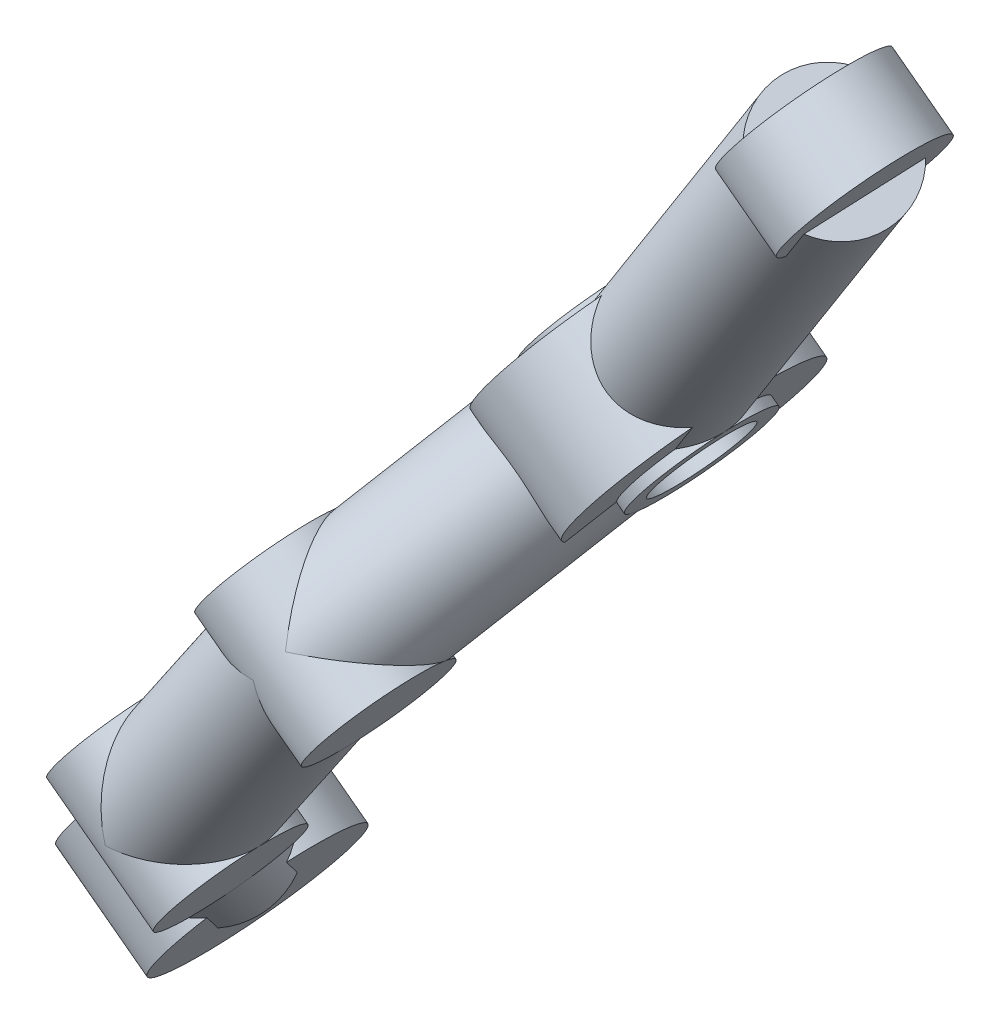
from build123d import *

# Parameters (mm, degrees)
BRAZO_1_PROFILE_R        = 3.5
BRAZO_2_PROFILE_R        = 3.5
BRAZO_3_PROFILE_R        = 3.5
BRAZO_4_PROFILE_R        = 3.5
BRAZO_CODO_1_PROFILE_R   = 3.5
BRAZO_CODO_2_PROFILE_R   = 3.5
BRAZO_CODO_3_PROFILE_R   = 3.5
OJO_PIVOTE_PROFILE_R     = 6
ANCLAJE_CABLE_PROFILE_R  = 4
OJO_ZAPATA_PROFILE_R     = 5
TALADRO_PIVOTE_PROFILE_R = 2.5


with BuildPart() as part:
    # Brazo_1: sweep along a curve in space
    with BuildLine() as brazo_1_path:
        Line((-219.3921140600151, 374.952663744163, 33), (-236.16766000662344, 352.53434404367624, 26))
    # Brazo_1 profile (on start of the path) → Brazo_1 (sweep)
    with BuildSketch(Plane(origin=(-219.3921140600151, 374.952663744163, 33), x_dir=(-0.8006542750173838, 0.5991266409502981, 0), z_dir=(-0.5812382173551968, -0.776748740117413, -0.24253562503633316))):
        Circle(BRAZO_1_PROFILE_R)
    sweep(path=brazo_1_path.line)

    # Brazo_2: sweep along a curve in space
    with BuildLine() as brazo_2_path:
        Line((-236.16766000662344, 352.53434404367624, 26), (-245.1545596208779, 340.52452991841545, 34))
    # Brazo_2 profile (on start of the path) → Brazo_2 (sweep)
    with BuildSketch(Plane(origin=(-236.16766000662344, 352.53434404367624, 26), x_dir=(-0.8006542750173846, 0.5991266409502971, 0), z_dir=(-0.5286411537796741, -0.7064596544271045, 0.4705882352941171))):
        Circle(BRAZO_2_PROFILE_R)
    sweep(path=brazo_2_path.line)

    # Brazo_3: sweep along a curve in space
    with BuildLine() as brazo_3_path:
        Line((-245.1545596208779, 340.52452991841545, 34), (-255.93883915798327, 326.11275296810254, 31))
    # Brazo_3 profile (on start of the path) → Brazo_3 (sweep)
    with BuildSketch(Plane(origin=(-245.1545596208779, 340.52452991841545, 34), x_dir=(-0.8006542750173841, 0.599126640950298, 0), z_dir=(-0.5909748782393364, -0.7897605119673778, -0.16439898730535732))):
        Circle(BRAZO_3_PROFILE_R)
    sweep(path=brazo_3_path.line)

    # Brazo_4: sweep along a curve in space
    with BuildLine() as brazo_4_path:
        Line((-255.93883915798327, 326.11275296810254, 31), (-263.1283588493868, 316.50490166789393, 22))
    # Brazo_4 profile (on start of the path) → Brazo_4 (sweep)
    with BuildSketch(Plane(origin=(-255.93883915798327, 326.11275296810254, 31), x_dir=(0, 0.6836434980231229, -0.729816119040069), z_dir=(-0.4793013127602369, -0.6405234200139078, -0.6000000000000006))):
        Circle(BRAZO_4_PROFILE_R)
    sweep(path=brazo_4_path.line)

    # Brazo_codo_1: sweep along a curve in space
    with BuildLine() as brazo_codo_1_path:
        Line((-233.3653700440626, 350.4374008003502, 26), (-238.96994996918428, 354.6312872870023, 26))
    # Brazo_codo_1 profile (on start of the path) → Brazo_codo_1 (sweep)
    with BuildSketch(Plane(origin=(-233.3653700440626, 350.4374008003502, 26), x_dir=(-0.599126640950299, -0.8006542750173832, 0), z_dir=(-0.8006542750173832, 0.599126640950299, 0))):
        Circle(BRAZO_CODO_1_PROFILE_R)
    sweep(path=brazo_codo_1_path.line)

    # Brazo_codo_2: sweep along a curve in space
    with BuildLine() as brazo_codo_2_path:
        Line((-242.35226965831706, 338.4275866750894, 34), (-247.95684958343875, 342.6214731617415, 34))
    # Brazo_codo_2 profile (on start of the path) → Brazo_codo_2 (sweep)
    with BuildSketch(Plane(origin=(-242.35226965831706, 338.4275866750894, 34), x_dir=(-0.599126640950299, -0.8006542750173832, 0), z_dir=(-0.8006542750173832, 0.599126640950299, 0))):
        Circle(BRAZO_CODO_2_PROFILE_R)
    sweep(path=brazo_codo_2_path.line)

    # Brazo_codo_3: sweep along a curve in space
    with BuildLine() as brazo_codo_3_path:
        Line((-253.13654919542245, 324.0158097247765, 31), (-258.7411291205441, 328.2096962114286, 31))
    # Brazo_codo_3 profile (on start of the path) → Brazo_codo_3 (sweep)
    with BuildSketch(Plane(origin=(-253.13654919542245, 324.0158097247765, 31), x_dir=(-0.5991266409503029, -0.8006542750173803, 0), z_dir=(-0.8006542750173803, 0.5991266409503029, 0))):
        Circle(BRAZO_CODO_3_PROFILE_R)
    sweep(path=brazo_codo_3_path.line)

    # Ojo_pivote: sweep along a curve in space
    with BuildLine() as ojo_pivote_path:
        Line((-233.76569718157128, 350.73696412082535, 26), (-238.5696228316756, 354.33172396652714, 26))
    # Ojo_pivote profile (on start of the path) → Ojo_pivote (sweep)
    with BuildSketch(Plane(origin=(-233.76569718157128, 350.73696412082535, 26), x_dir=(-0.5991266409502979, -0.8006542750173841, 0), z_dir=(-0.8006542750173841, 0.5991266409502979, 0))):
        Circle(OJO_PIVOTE_PROFILE_R)
    sweep(path=ojo_pivote_path.line)

    # Anclaje_cable: sweep along a curve in space
    with BuildLine() as anclaje_cable_path:
        Line((-217.79080550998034, 373.7544104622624, 33), (-220.9934226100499, 376.15091702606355, 33))
    # Anclaje_cable profile (on start of the path) → Anclaje_cable (sweep)
    with BuildSketch(Plane(origin=(-217.79080550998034, 373.7544104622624, 33), x_dir=(-0.5991266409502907, -0.8006542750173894, 0), z_dir=(-0.8006542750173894, 0.5991266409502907, 0))):
        Circle(ANCLAJE_CABLE_PROFILE_R)
    sweep(path=anclaje_cable_path.line)

    # Ojo_zapata: sweep along a curve in space
    with BuildLine() as ojo_zapata_path:
        Line((-260.7263960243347, 314.70752174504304, 22), (-265.530321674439, 318.3022815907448, 22))
    # Ojo_zapata profile (on start of the path) → Ojo_zapata (sweep)
    with BuildSketch(Plane(origin=(-260.7263960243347, 314.70752174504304, 22), x_dir=(-0.5991266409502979, -0.8006542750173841, 0), z_dir=(-0.8006542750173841, 0.5991266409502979, 0))):
        Circle(OJO_ZAPATA_PROFILE_R)
    sweep(path=ojo_zapata_path.line)

    # Taladro_pivote: sweep along a curve in space
    with BuildLine() as taladro_pivote_path:
        Line((-232.9650429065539, 350.13783747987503, 26), (-239.37027710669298, 354.93085060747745, 26))
    # Taladro_pivote profile (on start of the path) → Taladro_pivote (sweep, cut)
    with BuildSketch(Plane(origin=(-232.9650429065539, 350.13783747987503, 26), x_dir=(-0.5991266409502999, -0.8006542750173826, 0), z_dir=(-0.8006542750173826, 0.5991266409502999, 0))):
        Circle(TALADRO_PIVOTE_PROFILE_R)
    sweep(path=taladro_pivote_path.line, mode=Mode.SUBTRACT)


solid = part.part
